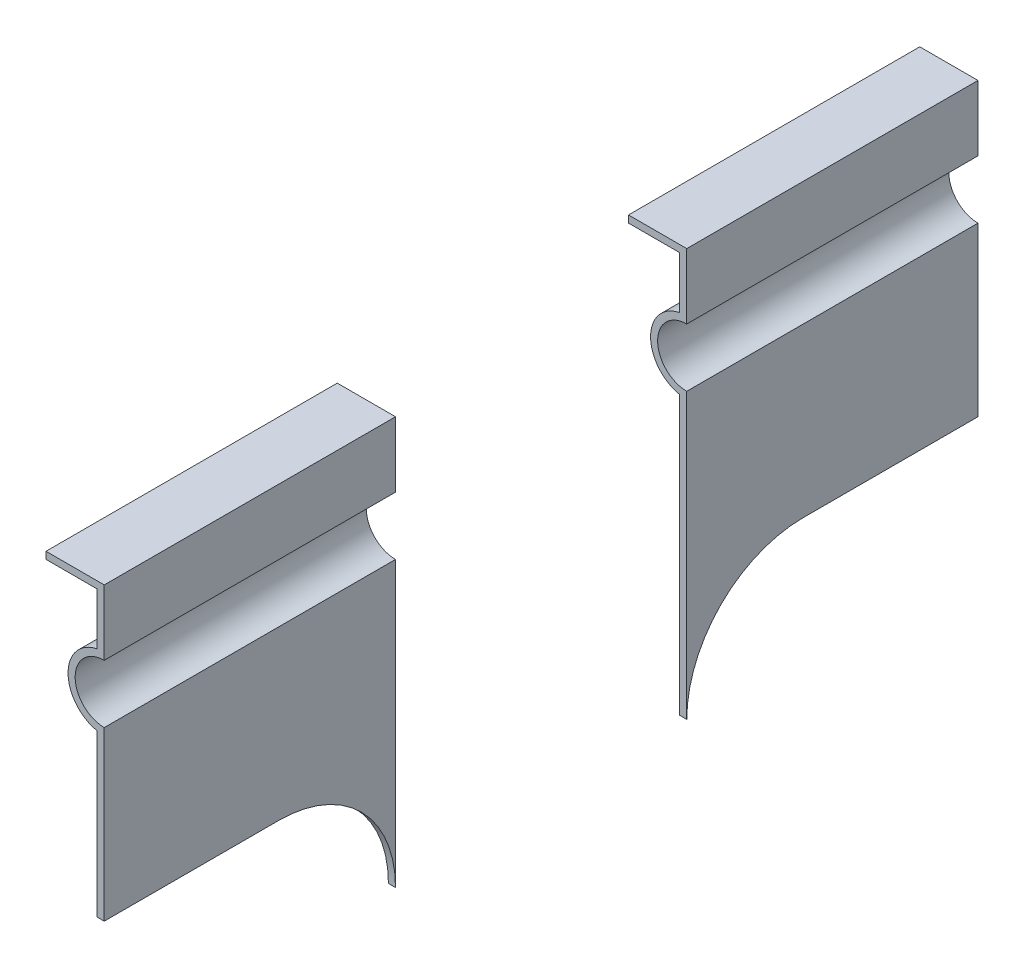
from build123d import *

# Parameters (mm, degrees)
EXTRUDE1_DEPTH      = 150
EXTRUDE2_DEPTH      = 150
EXTRUDE2_DEPTH_BACK = 150
EXTRUDE3_DEPTH      = 181.491533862
EXTRUDE3_DEPTH_BACK = 181.491533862
EXTRUDE4_DEPTH      = 181.491533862
EXTRUDE4_DEPTH_BACK = 181.491533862


with BuildPart() as part:
    # Sketch1 → Extrude1 (new body)
    with BuildSketch(Plane.XY):
        with BuildLine():
            Line((1.214, -1.214), (1.214, -11.214))
            ThreePointArc((1.214, -11.214), (-3.786, -16.214), (1.214, -21.214))
            Line((1.214, -21.214), (1.214, -100))
            Line((1.214, -100), (0, -100))
            Line((0, -100), (0, -22.308259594))
            ThreePointArc((0, -22.308259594), (-5, -16.214), (0, -10.119740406))
            Line((0, -10.119740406), (0, -1.214))
            Line((0, -1.214), (-8.786, -1.214))
            Line((-8.786, -1.214), (-8.786, 0))
            Line((-8.786, 0), (1.214, 0))
            Line((1.214, 0), (1.214, -1.214))
        make_face()
    extrude(amount=EXTRUDE1_DEPTH)

    # Sketch2 → Extrude2 (cut, two sides: drawn at the far end of the back side and taken through both)
    with BuildSketch(Plane(origin=(1.214, 0, 0), x_dir=(0, 0, -1), z_dir=(1, 0, 0)).offset(-EXTRUDE2_DEPTH_BACK)):
        Polygon((-75, -100), (-50, -100), (-50, 86.855094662), (-100, 86.855094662), (-100, -100), align=None)
    extrude(amount=EXTRUDE2_DEPTH + EXTRUDE2_DEPTH_BACK, mode=Mode.SUBTRACT)


with BuildPart() as extrude2_piece_1:
    # of the separate pieces the step leaves, piece 1, a body of its own (extrude2_pieces)
    add(part.part.solids().sort_by_distance((0, -10.119740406, 0))[0])

    # Sketch3 → Extrude3 (cut, two sides: drawn at the far end of the back side and taken through both)
    with BuildSketch(Plane.ZY.offset(-EXTRUDE3_DEPTH_BACK)):
        with BuildLine():
            Line((-326.227766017, -50), (0, -50))
            Line((0, -50), (30, -50))
            ThreePointArc((30, -50), (44.142135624, -55.857864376), (50, -70))
            Line((50, -70), (50, -100))
            Line((50, -100), (50, -426.227766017))
            Line((50, -426.227766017), (-411.355731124, -887.583497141))
            Line((-411.355731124, -887.583497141), (-787.583497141, -511.355731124))
            Line((-787.583497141, -511.355731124), (-326.227766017, -50))
        make_face()
    extrude(amount=EXTRUDE3_DEPTH + EXTRUDE3_DEPTH_BACK, mode=Mode.SUBTRACT)


with BuildPart() as extrude2_piece_2:
    # of the separate pieces the step leaves, piece 2, a body of its own (extrude2_pieces)
    add(part.part.solids().sort_by_distance((0, -1.214, 100))[0])

    # Sketch4 → Extrude4 (cut, two sides: drawn at the far end of the back side and taken through both)
    with BuildSketch(Plane.ZY.offset(-EXTRUDE4_DEPTH_BACK)):
        with BuildLine():
            Line((150, 370.555127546), (150, 0))
            Line((150, 0), (150, -50))
            Line((150, -50), (120, -50))
            ThreePointArc((120, -50), (105.857864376, -55.857864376), (100, -70))
            Line((100, -70), (100, -100))
            Line((100, -100), (100, -470.555127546))
            Line((100, -470.555127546), (839.804271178, -514.532969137))
            Line((839.804271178, -514.532969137), (889.804271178, 326.577285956))
            Line((889.804271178, 326.577285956), (150, 370.555127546))
        make_face()
    extrude(amount=EXTRUDE4_DEPTH + EXTRUDE4_DEPTH_BACK, mode=Mode.SUBTRACT)


solid = Compound([extrude2_piece_1.part, extrude2_piece_2.part])
